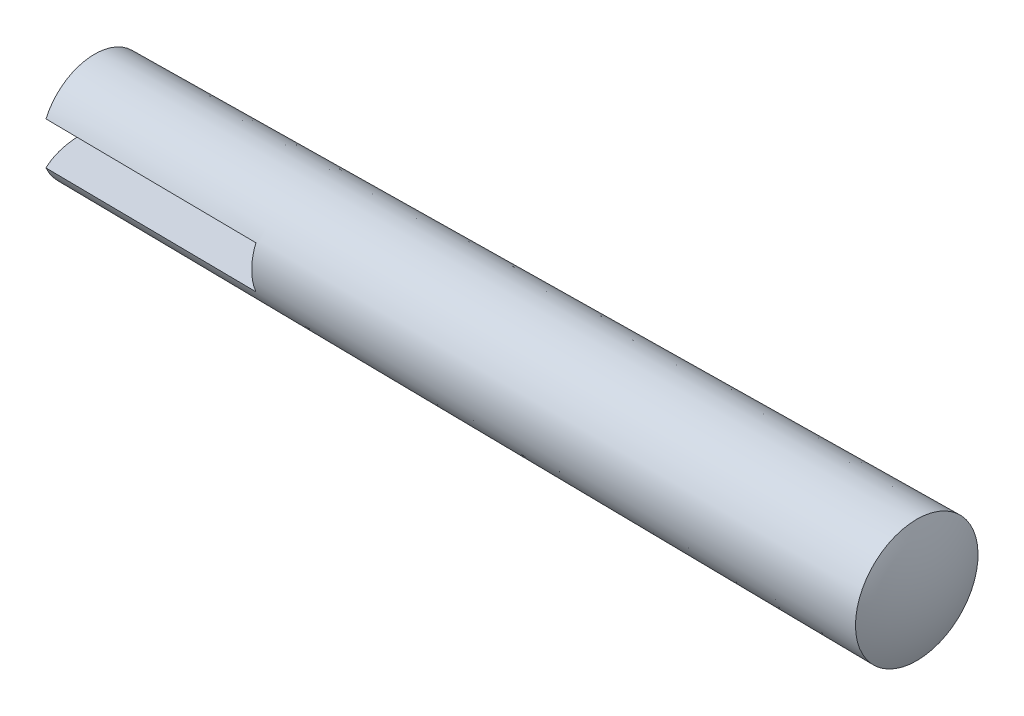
ISO-10303-21;
HEADER;
FILE_DESCRIPTION(('STEP AP214'),'2;1');
FILE_NAME('part.step','',(''),(''),'','','');
FILE_SCHEMA(('AUTOMOTIVE_DESIGN { 1 0 10303 214 1 1 1 1 }'));
ENDSEC;
DATA;
#1=APPLICATION_CONTEXT('core data for automotive mechanical design processes');
#2=APPLICATION_PROTOCOL_DEFINITION('international standard','automotive_design',2000,#1);
#3=PRODUCT_CONTEXT('',#1,'mechanical');
#4=PRODUCT('Part','Part','',(#3));
#5=PRODUCT_RELATED_PRODUCT_CATEGORY('part','',(#4));
#6=PRODUCT_DEFINITION_FORMATION('','',#4);
#7=PRODUCT_DEFINITION_CONTEXT('part definition',#1,'design');
#8=PRODUCT_DEFINITION('design','',#6,#7);
#9=PRODUCT_DEFINITION_SHAPE('','',#8);
#10=(LENGTH_UNIT() NAMED_UNIT(*) SI_UNIT(.MILLI.,.METRE.));
#11=(NAMED_UNIT(*) PLANE_ANGLE_UNIT() SI_UNIT($,.RADIAN.));
#12=(NAMED_UNIT(*) SI_UNIT($,.STERADIAN.) SOLID_ANGLE_UNIT());
#13=UNCERTAINTY_MEASURE_WITH_UNIT(LENGTH_MEASURE(1.E-05),#10,'distance_accuracy_value','');
#14=(GEOMETRIC_REPRESENTATION_CONTEXT(3) GLOBAL_UNCERTAINTY_ASSIGNED_CONTEXT((#13)) GLOBAL_UNIT_ASSIGNED_CONTEXT((#10,
#11,#12)) REPRESENTATION_CONTEXT('',''));
#15=CARTESIAN_POINT('',(0.,0.,0.));
#16=DIRECTION('',(0.,0.,1.));
#17=DIRECTION('',(1.,0.,0.));
#18=AXIS2_PLACEMENT_3D('',#15,#16,#17);
#19=CARTESIAN_POINT('',(5.27531746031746,0.,0.));
#20=DIRECTION('',(-1.,0.,0.));
#21=DIRECTION('',(0.,1.,0.));
#22=AXIS2_PLACEMENT_3D('',#19,#20,#21);
#23=SPHERICAL_SURFACE('',#22,5.27531746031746);
#24=CARTESIAN_POINT('',(0.63,0.,0.));
#25=DIRECTION('',(-1.,0.,0.));
#26=DIRECTION('',(0.,0.,1.));
#27=AXIS2_PLACEMENT_3D('',#24,#25,#26);
#28=CIRCLE('',#27,2.5);
#29=CARTESIAN_POINT('',(0.629999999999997,1.,2.29128784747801));
#30=VERTEX_POINT('',#29);
#31=CARTESIAN_POINT('',(0.63,1.,-2.29128784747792));
#32=VERTEX_POINT('',#31);
#33=EDGE_CURVE('E128',#30,#32,#28,.T.);
#34=ORIENTED_EDGE('',*,*,#33,.T.);
#35=CARTESIAN_POINT('',(5.27531746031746,1.,0.));
#36=DIRECTION('',(0.,1.,0.));
#37=DIRECTION('',(0.,0.,1.));
#38=AXIS2_PLACEMENT_3D('',#35,#36,#37);
#39=CIRCLE('',#38,5.1796693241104);
#40=EDGE_CURVE('E68',#32,#30,#39,.T.);
#41=ORIENTED_EDGE('',*,*,#40,.T.);
#42=EDGE_LOOP('',(#34,#41));
#43=FACE_BOUND('',#42,.T.);
#44=ADVANCED_FACE('F39',(#43),#23,.T.);
#45=CARTESIAN_POINT('',(33.068270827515,0.,0.));
#46=DIRECTION('',(-1.,0.,0.));
#47=DIRECTION('',(0.,1.,0.));
#48=AXIS2_PLACEMENT_3D('',#45,#46,#47);
#49=SPHERICAL_SURFACE('',#48,6.93172917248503);
#50=CARTESIAN_POINT('',(39.37,0.,0.));
#51=DIRECTION('',(-1.,0.,0.));
#52=DIRECTION('',(0.,0.,1.));
#53=AXIS2_PLACEMENT_3D('',#50,#51,#52);
#54=CIRCLE('',#53,2.88739999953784);
#55=CARTESIAN_POINT('',(39.37,0.,2.88739999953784));
#56=VERTEX_POINT('',#55);
#57=EDGE_CURVE('E131',#56,#56,#54,.T.);
#58=ORIENTED_EDGE('',*,*,#57,.F.);
#59=EDGE_LOOP('',(#58));
#60=FACE_BOUND('',#59,.T.);
#61=ADVANCED_FACE('F41',(#60),#49,.T.);
#62=CARTESIAN_POINT('',(0.63,-1.,-2.29128784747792));
#63=VERTEX_POINT('',#62);
#64=CARTESIAN_POINT('',(0.629999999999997,-1.,2.29128784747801));
#65=VERTEX_POINT('',#64);
#66=EDGE_CURVE('E104',#63,#65,#28,.T.);
#67=ORIENTED_EDGE('',*,*,#66,.T.);
#68=CARTESIAN_POINT('',(5.27531746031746,-1.,0.));
#69=DIRECTION('',(0.,-1.,0.));
#70=DIRECTION('',(0.,0.,-1.));
#71=AXIS2_PLACEMENT_3D('',#68,#69,#70);
#72=CIRCLE('',#71,5.1796693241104);
#73=EDGE_CURVE('E135',#65,#63,#72,.T.);
#74=ORIENTED_EDGE('',*,*,#73,.T.);
#75=EDGE_LOOP('',(#67,#74));
#76=FACE_BOUND('',#75,.T.);
#77=ADVANCED_FACE('F141',(#76),#23,.T.);
#78=CARTESIAN_POINT('',(39.37,0.,0.));
#79=DIRECTION('',(1.,0.,0.));
#80=DIRECTION('',(0.,0.,-1.));
#81=AXIS2_PLACEMENT_3D('',#78,#79,#80);
#82=CONICAL_SURFACE('',#81,2.88739999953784,0.00999966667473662);
#83=CARTESIAN_POINT('',(10.63,0.,0.));
#84=DIRECTION('',(-1.,0.,0.));
#85=DIRECTION('',(0.,0.,1.));
#86=AXIS2_PLACEMENT_3D('',#83,#84,#85);
#87=CIRCLE('',#86,2.5999999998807);
#88=CARTESIAN_POINT('',(10.63,1.,-2.39999999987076));
#89=VERTEX_POINT('',#88);
#90=CARTESIAN_POINT('',(10.63,-1.,-2.39999999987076));
#91=VERTEX_POINT('',#90);
#92=EDGE_CURVE('E84',#89,#91,#87,.T.);
#93=ORIENTED_EDGE('',*,*,#92,.F.);
#94=CARTESIAN_POINT('',(-3.70900834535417,1.,-2.24386547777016));
#95=CARTESIAN_POINT('',(-2.05482586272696,1.,-2.26197544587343));
#96=CARTESIAN_POINT('',(-0.400642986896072,1.,-2.28004944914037));
#97=CARTESIAN_POINT('',(2.90772350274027,1.,-2.31612978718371));
#98=CARTESIAN_POINT('',(4.56190711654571,1.,-2.33413612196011));
#99=CARTESIAN_POINT('',(12.8328269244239,1.,-2.42400927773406));
#100=CARTESIAN_POINT('',(19.4495682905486,1.,-2.49540054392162));
#101=CARTESIAN_POINT('',(26.0663136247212,1.,-2.56642090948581));
#102=B_SPLINE_CURVE_WITH_KNOTS('',3,(#94,#95,#96,#97,#98,#99,#100,#101),.UNSPECIFIED.,.F.,.F.,
(4,2,2,4),(0.,4.96284483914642,9.92568967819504,29.7770690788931),.UNSPECIFIED.);
#103=EDGE_CURVE('E11',#89,#32,#102,.F.);
#104=ORIENTED_EDGE('',*,*,#103,.T.);
#105=ORIENTED_EDGE('',*,*,#33,.F.);
#106=CARTESIAN_POINT('',(-3.70900834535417,1.,2.24386547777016));
#107=CARTESIAN_POINT('',(-2.05482586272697,1.,2.26197544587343));
#108=CARTESIAN_POINT('',(-0.400642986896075,1.,2.28004944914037));
#109=CARTESIAN_POINT('',(2.90772350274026,1.,2.31612978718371));
#110=CARTESIAN_POINT('',(4.56190711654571,1.,2.33413612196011));
#111=CARTESIAN_POINT('',(12.8328269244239,1.,2.42400927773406));
#112=CARTESIAN_POINT('',(19.4495682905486,1.,2.49540054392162));
#113=CARTESIAN_POINT('',(26.0663136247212,1.,2.56642090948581));
#114=B_SPLINE_CURVE_WITH_KNOTS('',3,(#106,#107,#108,#109,#110,#111,#112,#113),.UNSPECIFIED.,.F.,
.F.,(4,2,2,4),(0.,4.96284483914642,9.92568967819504,29.7770690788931),.UNSPECIFIED.);
#115=CARTESIAN_POINT('',(10.63,1.,2.39999999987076));
#116=VERTEX_POINT('',#115);
#117=EDGE_CURVE('E90',#30,#116,#114,.T.);
#118=ORIENTED_EDGE('',*,*,#117,.T.);
#119=CARTESIAN_POINT('',(10.63,-1.,2.39999999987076));
#120=VERTEX_POINT('',#119);
#121=EDGE_CURVE('E92',#120,#116,#87,.T.);
#122=ORIENTED_EDGE('',*,*,#121,.F.);
#123=CARTESIAN_POINT('',(-3.70900834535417,-1.,2.24386547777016));
#124=CARTESIAN_POINT('',(-2.05482586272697,-1.,2.26197544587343));
#125=CARTESIAN_POINT('',(-0.400642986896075,-1.,2.28004944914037));
#126=CARTESIAN_POINT('',(2.90772350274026,-1.,2.31612978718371));
#127=CARTESIAN_POINT('',(4.56190711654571,-1.,2.33413612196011));
#128=CARTESIAN_POINT('',(12.8328269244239,-1.,2.42400927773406));
#129=CARTESIAN_POINT('',(19.4495682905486,-1.,2.49540054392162));
#130=CARTESIAN_POINT('',(26.0663136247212,-1.,2.56642090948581));
#131=B_SPLINE_CURVE_WITH_KNOTS('',3,(#123,#124,#125,#126,#127,#128,#129,#130),.UNSPECIFIED.,.F.,
.F.,(4,2,2,4),(0.,4.96284483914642,9.92568967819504,29.7770690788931),.UNSPECIFIED.);
#132=EDGE_CURVE('E97',#120,#65,#131,.F.);
#133=ORIENTED_EDGE('',*,*,#132,.T.);
#134=ORIENTED_EDGE('',*,*,#66,.F.);
#135=CARTESIAN_POINT('',(-3.70900834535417,-1.,-2.24386547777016));
#136=CARTESIAN_POINT('',(-2.05482586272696,-1.,-2.26197544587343));
#137=CARTESIAN_POINT('',(-0.400642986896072,-1.,-2.28004944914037));
#138=CARTESIAN_POINT('',(2.90772350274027,-1.,-2.31612978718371));
#139=CARTESIAN_POINT('',(4.56190711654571,-1.,-2.33413612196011));
#140=CARTESIAN_POINT('',(12.8328269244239,-1.,-2.42400927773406));
#141=CARTESIAN_POINT('',(19.4495682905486,-1.,-2.49540054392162));
#142=CARTESIAN_POINT('',(26.0663136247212,-1.,-2.56642090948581));
#143=B_SPLINE_CURVE_WITH_KNOTS('',3,(#135,#136,#137,#138,#139,#140,#141,#142),.UNSPECIFIED.,.F.,
.F.,(4,2,2,4),(0.,4.96284483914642,9.92568967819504,29.7770690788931),.UNSPECIFIED.);
#144=EDGE_CURVE('E53',#63,#91,#143,.T.);
#145=ORIENTED_EDGE('',*,*,#144,.T.);
#146=EDGE_LOOP('',(#93,#104,#105,#118,#122,#133,#134,#145));
#147=FACE_BOUND('',#146,.T.);
#148=ORIENTED_EDGE('',*,*,#57,.T.);
#149=EDGE_LOOP('',(#148));
#150=FACE_BOUND('',#149,.T.);
#151=ADVANCED_FACE('F101',(#147,#150),#82,.T.);
#152=CARTESIAN_POINT('',(0.,1.,2.88739999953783));
#153=DIRECTION('',(0.,1.,0.));
#154=DIRECTION('',(0.,0.,1.));
#155=AXIS2_PLACEMENT_3D('',#152,#153,#154);
#156=PLANE('',#155);
#157=DIRECTION('',(0.,0.,1.));
#158=VECTOR('',#157,1.);
#159=CARTESIAN_POINT('',(10.63,1.,2.88739999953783));
#160=LINE('',#159,#158);
#161=EDGE_CURVE('E87',#89,#116,#160,.T.);
#162=ORIENTED_EDGE('',*,*,#161,.T.);
#163=ORIENTED_EDGE('',*,*,#117,.F.);
#164=ORIENTED_EDGE('',*,*,#40,.F.);
#165=ORIENTED_EDGE('',*,*,#103,.F.);
#166=EDGE_LOOP('',(#162,#163,#164,#165));
#167=FACE_BOUND('',#166,.T.);
#168=ADVANCED_FACE('F119',(#167),#156,.F.);
#169=CARTESIAN_POINT('',(0.,-1.,2.88739999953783));
#170=DIRECTION('',(0.,-1.,0.));
#171=DIRECTION('',(0.,0.,-1.));
#172=AXIS2_PLACEMENT_3D('',#169,#170,#171);
#173=PLANE('',#172);
#174=ORIENTED_EDGE('',*,*,#73,.F.);
#175=ORIENTED_EDGE('',*,*,#132,.F.);
#176=DIRECTION('',(0.,0.,-1.));
#177=VECTOR('',#176,1.);
#178=CARTESIAN_POINT('',(10.63,-1.,2.88739999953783));
#179=LINE('',#178,#177);
#180=EDGE_CURVE('E60',#120,#91,#179,.T.);
#181=ORIENTED_EDGE('',*,*,#180,.T.);
#182=ORIENTED_EDGE('',*,*,#144,.F.);
#183=EDGE_LOOP('',(#174,#175,#181,#182));
#184=FACE_BOUND('',#183,.T.);
#185=ADVANCED_FACE('F94',(#184),#173,.F.);
#186=CARTESIAN_POINT('',(10.63,1.,2.88739999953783));
#187=DIRECTION('',(-1.,0.,0.));
#188=DIRECTION('',(0.,0.,1.));
#189=AXIS2_PLACEMENT_3D('',#186,#187,#188);
#190=PLANE('',#189);
#191=ORIENTED_EDGE('',*,*,#92,.T.);
#192=ORIENTED_EDGE('',*,*,#180,.F.);
#193=ORIENTED_EDGE('',*,*,#121,.T.);
#194=ORIENTED_EDGE('',*,*,#161,.F.);
#195=EDGE_LOOP('',(#191,#192,#193,#194));
#196=FACE_BOUND('',#195,.T.);
#197=ADVANCED_FACE('F85',(#196),#190,.T.);
#198=CLOSED_SHELL('',(#44,#61,#77,#151,#168,#185,#197));
#199=MANIFOLD_SOLID_BREP('B2',#198);
#200=ADVANCED_BREP_SHAPE_REPRESENTATION('',(#18,#199),#14);
#201=SHAPE_DEFINITION_REPRESENTATION(#9,#200);
ENDSEC;
END-ISO-10303-21;
